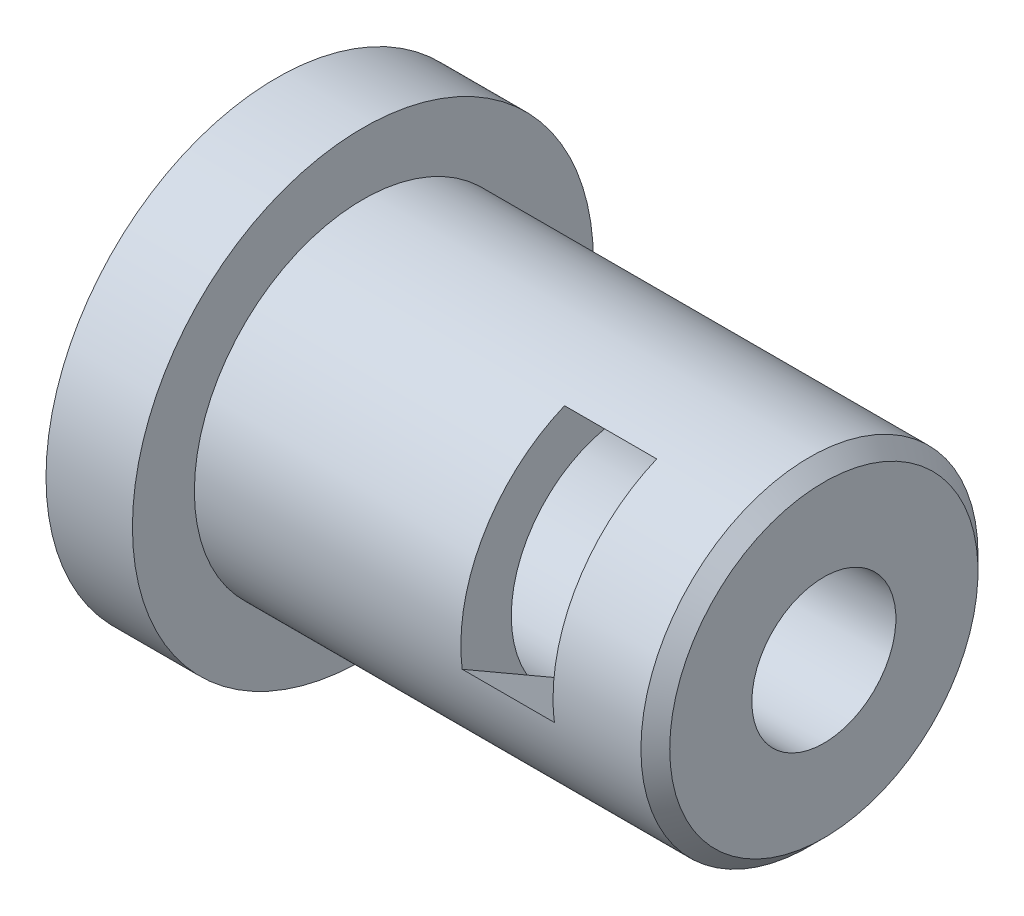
from build123d import *

# Parameters (mm, degrees)
CHANFREIN3_SIZE         = 0.5
ENL_V_START             = -12.25
ENL_V_MAT_EXTRU_2_DEPTH = 3.2
ESQUISSE4_W             = 3.2
ESQUISSE4_H             = 7.1
ENL_V_MAT_EXTRU_4_DEPTH = 23.113344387


with BuildPart() as part:
    # Esquisse1 → R_volution1 (revolve)
    with BuildSketch(Plane.XY, mode=Mode.PRIVATE) as r_volution1_sk:
        Polygon((0, 4.1), (0, 8), (3, 8), (3, 5.85), (19, 5.85), (19, 2.5), (12.25, 2.5), (12.25, 4.1), align=None)
    revolve(r_volution1_sk.sketch.rotate(Axis((-9.410622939, 0, 0), (1, 0, 0)), 90), axis=Axis((-9.410622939, 0, 0), (1, 0, 0)))

    # Chanfrein3
    chanfrein3_edges = [part.edges().sort_by_distance(p)[0] for p in [
        (0, 0, -4.1),
        (19, 0, -5.85),
    ]]
    chamfer(chanfrein3_edges, length=CHANFREIN3_SIZE)

    # Esquisse2 → Enl_v. mat.-Extru.2 (cut)
    with BuildSketch(Plane.ZY.offset(ENL_V_START)):
        Polygon((3.55, -2.049593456), (3.55, 2.049593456), (0, 4.099186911), (-3.55, 2.049593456), (-3.55, -2.049593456), (0, -4.099186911), align=None)
    extrude(amount=-ENL_V_MAT_EXTRU_2_DEPTH, mode=Mode.SUBTRACT)

    # Esquisse4 → Enl_v. mat.-Extru.4 (cut, through all)
    with BuildSketch(Plane(origin=(0, 0, 0), x_dir=(-1, 0, 0), z_dir=(0, -0.49999999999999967, -0.8660254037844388))):
        with Locations((-13.85, 0)):
            Rectangle(ESQUISSE4_W, ESQUISSE4_H)
    extrude(amount=-ENL_V_MAT_EXTRU_4_DEPTH, mode=Mode.SUBTRACT)


solid = part.part
